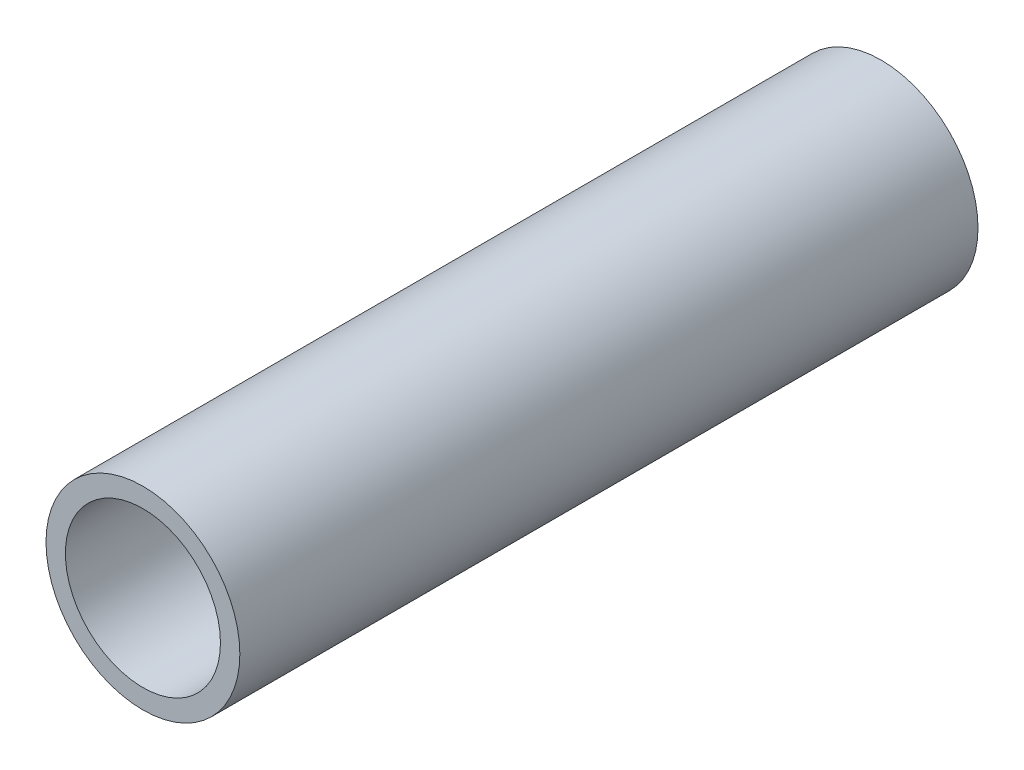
from build123d import *

# Parameters (mm, degrees)
SKETCH1_R           = 15.875
SKETCH1_R_2         = 12.7
BOSS_EXTRUDE1_DEPTH = 60.452


with BuildPart() as part:
    # Sketch1 → Boss-Extrude1 (new, symmetric)
    with BuildSketch(Plane.XY):
        Circle(SKETCH1_R)
        Circle(SKETCH1_R_2, mode=Mode.SUBTRACT)
    extrude(amount=BOSS_EXTRUDE1_DEPTH, both=True)


solid = part.part
